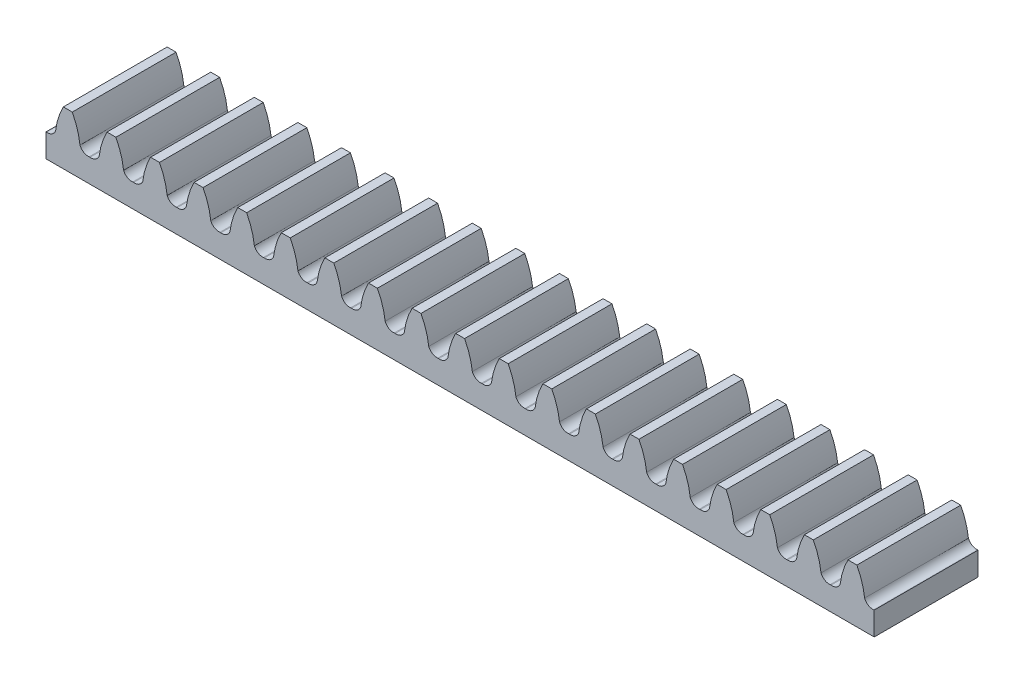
from build123d import *

# Parameters (mm, degrees)
AUFSATZ_LINEAR_AUSTRAGEN1_DEPTH = 40


with BuildPart() as part:
    # Skizze1 → Aufsatz-Linear austragen1 (new body)
    with BuildSketch(Plane.XY):
        with BuildLine():
            Line((0, 0), (8.4, 0))
            Line((8.4, 0), (319.2, 0))
            Line((319.2, 0), (319.2, 9))
            Line((319.2, 9), (319.027151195, 9))
            ThreePointArc((319.027151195, 9), (316.906559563, 9.470389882), (315.510123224, 11.134163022))
            ThreePointArc((315.510123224, 11.134163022), (314.459071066, 16.041282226), (312.522188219, 20.67086259))
            ThreePointArc((312.522188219, 20.67086259), (310.8, 20.69), (309.077811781, 20.67086259))
            ThreePointArc((309.077811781, 20.67086259), (307.140928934, 16.041282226), (306.089876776, 11.134163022))
            ThreePointArc((306.089876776, 11.134163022), (304.693440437, 9.470389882), (302.572848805, 9))
            Line((302.572848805, 9), (302.4, 9))
            Line((302.4, 9), (302.227151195, 9))
            ThreePointArc((302.227151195, 9), (300.106559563, 9.470389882), (298.710123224, 11.134163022))
            ThreePointArc((298.710123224, 11.134163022), (297.659071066, 16.041282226), (295.722188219, 20.67086259))
            ThreePointArc((295.722188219, 20.67086259), (294, 20.69), (292.277811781, 20.67086259))
            ThreePointArc((292.277811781, 20.67086259), (290.340928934, 16.041282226), (289.289876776, 11.134163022))
            ThreePointArc((289.289876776, 11.134163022), (287.893440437, 9.470389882), (285.772848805, 9))
            Line((285.772848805, 9), (285.6, 9))
            Line((285.6, 9), (285.427151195, 9))
            ThreePointArc((285.427151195, 9), (283.306559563, 9.470389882), (281.910123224, 11.134163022))
            ThreePointArc((281.910123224, 11.134163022), (280.859071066, 16.041282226), (278.922188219, 20.67086259))
            ThreePointArc((278.922188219, 20.67086259), (277.2, 20.69), (275.477811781, 20.67086259))
            ThreePointArc((275.477811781, 20.67086259), (273.540928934, 16.041282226), (272.489876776, 11.134163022))
            ThreePointArc((272.489876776, 11.134163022), (271.093440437, 9.470389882), (268.972848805, 9))
            Line((268.972848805, 9), (268.8, 9))
            Line((268.8, 9), (268.627151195, 9))
            ThreePointArc((268.627151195, 9), (266.506559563, 9.470389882), (265.110123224, 11.134163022))
            ThreePointArc((265.110123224, 11.134163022), (264.059071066, 16.041282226), (262.122188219, 20.67086259))
            ThreePointArc((262.122188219, 20.67086259), (260.4, 20.69), (258.677811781, 20.67086259))
            ThreePointArc((258.677811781, 20.67086259), (256.740928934, 16.041282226), (255.689876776, 11.134163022))
            ThreePointArc((255.689876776, 11.134163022), (254.293440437, 9.470389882), (252.172848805, 9))
            Line((252.172848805, 9), (252, 9))
            Line((252, 9), (251.827151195, 9))
            ThreePointArc((251.827151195, 9), (249.706559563, 9.470389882), (248.310123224, 11.134163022))
            ThreePointArc((248.310123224, 11.134163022), (247.259071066, 16.041282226), (245.322188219, 20.67086259))
            ThreePointArc((245.322188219, 20.67086259), (243.6, 20.69), (241.877811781, 20.67086259))
            ThreePointArc((241.877811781, 20.67086259), (239.940928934, 16.041282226), (238.889876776, 11.134163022))
            ThreePointArc((238.889876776, 11.134163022), (237.493440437, 9.470389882), (235.372848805, 9))
            Line((235.372848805, 9), (235.2, 9))
            Line((235.2, 9), (235.027151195, 9))
            ThreePointArc((235.027151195, 9), (232.906559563, 9.470389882), (231.510123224, 11.134163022))
            ThreePointArc((231.510123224, 11.134163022), (230.459071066, 16.041282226), (228.522188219, 20.67086259))
            ThreePointArc((228.522188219, 20.67086259), (226.8, 20.69), (225.077811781, 20.67086259))
            ThreePointArc((225.077811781, 20.67086259), (223.140928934, 16.041282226), (222.089876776, 11.134163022))
            ThreePointArc((222.089876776, 11.134163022), (220.693440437, 9.470389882), (218.572848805, 9))
            Line((218.572848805, 9), (218.4, 9))
            Line((218.4, 9), (218.227151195, 9))
            ThreePointArc((218.227151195, 9), (216.106559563, 9.470389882), (214.710123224, 11.134163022))
            ThreePointArc((214.710123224, 11.134163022), (213.659071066, 16.041282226), (211.722188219, 20.67086259))
            ThreePointArc((211.722188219, 20.67086259), (210, 20.69), (208.277811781, 20.67086259))
            ThreePointArc((208.277811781, 20.67086259), (206.340928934, 16.041282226), (205.289876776, 11.134163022))
            ThreePointArc((205.289876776, 11.134163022), (203.893440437, 9.470389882), (201.772848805, 9))
            Line((201.772848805, 9), (201.6, 9))
            Line((201.6, 9), (201.427151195, 9))
            ThreePointArc((201.427151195, 9), (199.306559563, 9.470389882), (197.910123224, 11.134163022))
            ThreePointArc((197.910123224, 11.134163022), (196.859071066, 16.041282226), (194.922188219, 20.67086259))
            ThreePointArc((194.922188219, 20.67086259), (193.2, 20.69), (191.477811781, 20.67086259))
            ThreePointArc((191.477811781, 20.67086259), (189.540928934, 16.041282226), (188.489876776, 11.134163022))
            ThreePointArc((188.489876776, 11.134163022), (187.093440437, 9.470389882), (184.972848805, 9))
            Line((184.972848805, 9), (184.8, 9))
            Line((184.8, 9), (184.627151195, 9))
            ThreePointArc((184.627151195, 9), (182.506559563, 9.470389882), (181.110123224, 11.134163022))
            ThreePointArc((181.110123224, 11.134163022), (180.059071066, 16.041282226), (178.122188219, 20.67086259))
            ThreePointArc((178.122188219, 20.67086259), (176.4, 20.69), (174.677811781, 20.67086259))
            ThreePointArc((174.677811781, 20.67086259), (172.740928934, 16.041282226), (171.689876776, 11.134163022))
            ThreePointArc((171.689876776, 11.134163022), (170.293440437, 9.470389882), (168.172848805, 9))
            Line((168.172848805, 9), (168, 9))
            Line((168, 9), (167.827151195, 9))
            ThreePointArc((167.827151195, 9), (165.706559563, 9.470389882), (164.310123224, 11.134163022))
            ThreePointArc((164.310123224, 11.134163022), (163.259071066, 16.041282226), (161.322188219, 20.67086259))
            ThreePointArc((161.322188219, 20.67086259), (159.6, 20.69), (157.877811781, 20.67086259))
            ThreePointArc((157.877811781, 20.67086259), (155.940928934, 16.041282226), (154.889876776, 11.134163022))
            ThreePointArc((154.889876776, 11.134163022), (153.493440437, 9.470389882), (151.372848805, 9))
            Line((151.372848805, 9), (151.2, 9))
            Line((151.2, 9), (151.027151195, 9))
            ThreePointArc((151.027151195, 9), (148.906559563, 9.470389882), (147.510123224, 11.134163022))
            ThreePointArc((147.510123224, 11.134163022), (146.459071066, 16.041282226), (144.522188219, 20.67086259))
            ThreePointArc((144.522188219, 20.67086259), (142.8, 20.69), (141.077811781, 20.67086259))
            ThreePointArc((141.077811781, 20.67086259), (139.140928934, 16.041282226), (138.089876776, 11.134163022))
            ThreePointArc((138.089876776, 11.134163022), (136.693440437, 9.470389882), (134.572848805, 9))
            Line((134.572848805, 9), (134.4, 9))
            Line((134.4, 9), (134.227151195, 9))
            ThreePointArc((134.227151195, 9), (132.106559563, 9.470389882), (130.710123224, 11.134163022))
            ThreePointArc((130.710123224, 11.134163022), (129.659071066, 16.041282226), (127.722188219, 20.67086259))
            ThreePointArc((127.722188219, 20.67086259), (126, 20.69), (124.277811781, 20.67086259))
            ThreePointArc((124.277811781, 20.67086259), (122.340928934, 16.041282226), (121.289876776, 11.134163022))
            ThreePointArc((121.289876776, 11.134163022), (119.893440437, 9.470389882), (117.772848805, 9))
            Line((117.772848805, 9), (117.6, 9))
            Line((117.6, 9), (117.427151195, 9))
            ThreePointArc((117.427151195, 9), (115.306559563, 9.470389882), (113.910123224, 11.134163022))
            ThreePointArc((113.910123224, 11.134163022), (112.859071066, 16.041282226), (110.922188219, 20.67086259))
            ThreePointArc((110.922188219, 20.67086259), (109.2, 20.69), (107.477811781, 20.67086259))
            ThreePointArc((107.477811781, 20.67086259), (105.540928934, 16.041282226), (104.489876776, 11.134163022))
            ThreePointArc((104.489876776, 11.134163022), (103.093440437, 9.470389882), (100.972848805, 9))
            Line((100.972848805, 9), (100.8, 9))
            Line((100.8, 9), (100.627151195, 9))
            ThreePointArc((100.627151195, 9), (98.506559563, 9.470389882), (97.110123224, 11.134163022))
            ThreePointArc((97.110123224, 11.134163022), (96.059071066, 16.041282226), (94.122188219, 20.67086259))
            ThreePointArc((94.122188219, 20.67086259), (92.4, 20.69), (90.677811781, 20.67086259))
            ThreePointArc((90.677811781, 20.67086259), (88.740928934, 16.041282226), (87.689876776, 11.134163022))
            ThreePointArc((87.689876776, 11.134163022), (86.293440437, 9.470389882), (84.172848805, 9))
            Line((84.172848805, 9), (84, 9))
            Line((84, 9), (83.827151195, 9))
            ThreePointArc((83.827151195, 9), (81.706559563, 9.470389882), (80.310123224, 11.134163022))
            ThreePointArc((80.310123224, 11.134163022), (79.259071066, 16.041282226), (77.322188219, 20.67086259))
            ThreePointArc((77.322188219, 20.67086259), (75.6, 20.69), (73.877811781, 20.67086259))
            ThreePointArc((73.877811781, 20.67086259), (71.940928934, 16.041282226), (70.889876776, 11.134163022))
            ThreePointArc((70.889876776, 11.134163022), (69.493440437, 9.470389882), (67.372848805, 9))
            Line((67.372848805, 9), (67.2, 9))
            Line((67.2, 9), (67.027151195, 9))
            ThreePointArc((67.027151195, 9), (64.906559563, 9.470389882), (63.510123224, 11.134163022))
            ThreePointArc((63.510123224, 11.134163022), (62.459071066, 16.041282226), (60.522188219, 20.67086259))
            ThreePointArc((60.522188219, 20.67086259), (58.8, 20.69), (57.077811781, 20.67086259))
            ThreePointArc((57.077811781, 20.67086259), (55.140928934, 16.041282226), (54.089876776, 11.134163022))
            ThreePointArc((54.089876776, 11.134163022), (52.693440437, 9.470389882), (50.572848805, 9))
            Line((50.572848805, 9), (50.4, 9))
            Line((50.4, 9), (50.227151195, 9))
            ThreePointArc((50.227151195, 9), (48.106559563, 9.470389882), (46.710123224, 11.134163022))
            ThreePointArc((46.710123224, 11.134163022), (45.659071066, 16.041282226), (43.722188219, 20.67086259))
            ThreePointArc((43.722188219, 20.67086259), (42, 20.69), (40.277811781, 20.67086259))
            ThreePointArc((40.277811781, 20.67086259), (38.340928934, 16.041282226), (37.289876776, 11.134163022))
            ThreePointArc((37.289876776, 11.134163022), (35.893440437, 9.470389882), (33.772848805, 9))
            Line((33.772848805, 9), (33.6, 9))
            Line((33.6, 9), (33.427151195, 9))
            ThreePointArc((33.427151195, 9), (31.306559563, 9.470389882), (29.910123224, 11.134163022))
            ThreePointArc((29.910123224, 11.134163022), (28.859071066, 16.041282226), (26.922188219, 20.67086259))
            ThreePointArc((26.922188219, 20.67086259), (25.2, 20.69), (23.477811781, 20.67086259))
            ThreePointArc((23.477811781, 20.67086259), (21.540928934, 16.041282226), (20.489876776, 11.134163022))
            ThreePointArc((20.489876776, 11.134163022), (19.093440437, 9.470389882), (16.972848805, 9))
            Line((16.972848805, 9), (16.8, 9))
            Line((16.8, 9), (16.627151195, 9))
            ThreePointArc((16.627151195, 9), (14.506559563, 9.470389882), (13.110123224, 11.134163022))
            ThreePointArc((13.110123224, 11.134163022), (12.059071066, 16.041282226), (10.122188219, 20.67086259))
            ThreePointArc((10.122188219, 20.67086259), (8.4, 20.69), (6.677811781, 20.67086259))
            ThreePointArc((6.677811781, 20.67086259), (4.740928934, 16.041282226), (3.689876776, 11.134163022))
            ThreePointArc((3.689876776, 11.134163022), (2.293440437, 9.470389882), (0.172848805, 9))
            Line((0.172848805, 9), (0, 9))
            Line((0, 9), (0, 0))
        make_face()
    extrude(amount=AUFSATZ_LINEAR_AUSTRAGEN1_DEPTH)


solid = part.part
